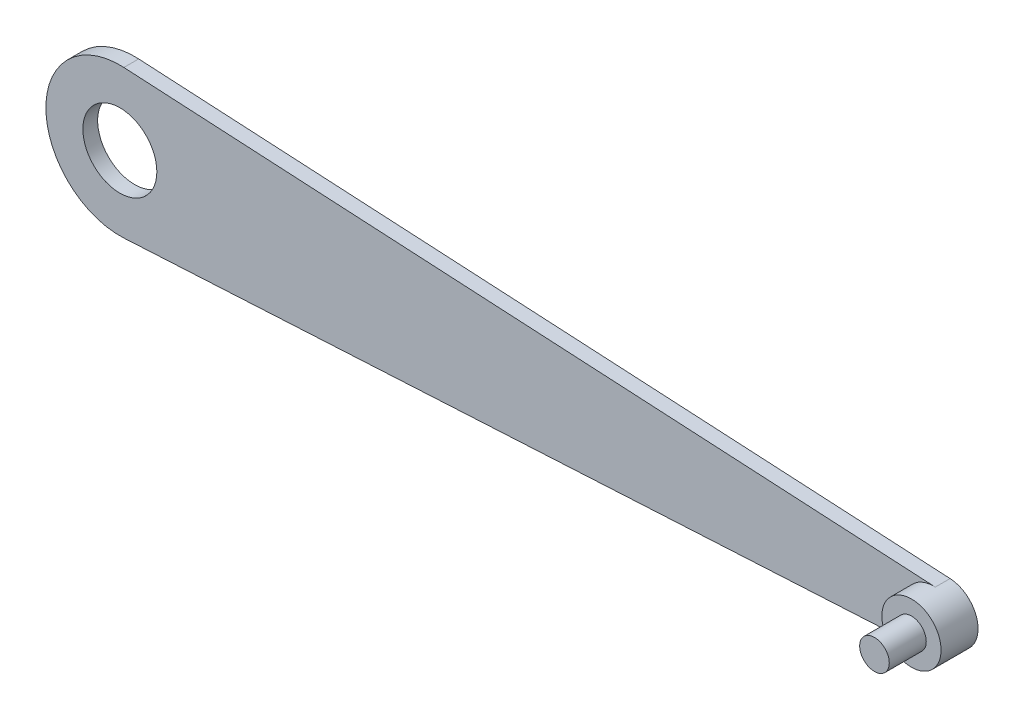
ISO-10303-21;
HEADER;
FILE_DESCRIPTION(('STEP AP214'),'2;1');
FILE_NAME('part.step','',(''),(''),'','','');
FILE_SCHEMA(('AUTOMOTIVE_DESIGN { 1 0 10303 214 1 1 1 1 }'));
ENDSEC;
DATA;
#1=APPLICATION_CONTEXT('core data for automotive mechanical design processes');
#2=APPLICATION_PROTOCOL_DEFINITION('international standard','automotive_design',2000,#1);
#3=PRODUCT_CONTEXT('',#1,'mechanical');
#4=PRODUCT('Part','Part','',(#3));
#5=PRODUCT_RELATED_PRODUCT_CATEGORY('part','',(#4));
#6=PRODUCT_DEFINITION_FORMATION('','',#4);
#7=PRODUCT_DEFINITION_CONTEXT('part definition',#1,'design');
#8=PRODUCT_DEFINITION('design','',#6,#7);
#9=PRODUCT_DEFINITION_SHAPE('','',#8);
#10=(LENGTH_UNIT() NAMED_UNIT(*) SI_UNIT(.MILLI.,.METRE.));
#11=(NAMED_UNIT(*) PLANE_ANGLE_UNIT() SI_UNIT($,.RADIAN.));
#12=(NAMED_UNIT(*) SI_UNIT($,.STERADIAN.) SOLID_ANGLE_UNIT());
#13=UNCERTAINTY_MEASURE_WITH_UNIT(LENGTH_MEASURE(1.E-05),#10,'distance_accuracy_value','');
#14=(GEOMETRIC_REPRESENTATION_CONTEXT(3) GLOBAL_UNCERTAINTY_ASSIGNED_CONTEXT((#13)) GLOBAL_UNIT_ASSIGNED_CONTEXT((#10,
#11,#12)) REPRESENTATION_CONTEXT('',''));
#15=CARTESIAN_POINT('',(0.,0.,0.));
#16=DIRECTION('',(0.,0.,1.));
#17=DIRECTION('',(1.,0.,0.));
#18=AXIS2_PLACEMENT_3D('',#15,#16,#17);
#19=CARTESIAN_POINT('',(0.,0.,1.));
#20=DIRECTION('',(0.,0.,-1.));
#21=DIRECTION('',(-1.,0.,0.));
#22=AXIS2_PLACEMENT_3D('',#19,#20,#21);
#23=CYLINDRICAL_SURFACE('',#22,5.);
#24=DIRECTION('',(0.,0.,-1.));
#25=VECTOR('',#24,1.);
#26=CARTESIAN_POINT('',(0.272727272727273,-4.99255644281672,1.));
#27=LINE('',#26,#25);
#28=CARTESIAN_POINT('',(0.272727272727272,-4.99255644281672,1.));
#29=VERTEX_POINT('',#28);
#30=CARTESIAN_POINT('',(0.272727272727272,-4.99255644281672,0.));
#31=VERTEX_POINT('',#30);
#32=EDGE_CURVE('E49',#29,#31,#27,.T.);
#33=ORIENTED_EDGE('',*,*,#32,.F.);
#34=CARTESIAN_POINT('',(0.,0.,1.));
#35=DIRECTION('',(0.,0.,1.));
#36=DIRECTION('',(1.,0.,0.));
#37=AXIS2_PLACEMENT_3D('',#34,#35,#36);
#38=CIRCLE('',#37,5.);
#39=CARTESIAN_POINT('',(0.272727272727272,4.99255644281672,1.));
#40=VERTEX_POINT('',#39);
#41=EDGE_CURVE('E11',#40,#29,#38,.T.);
#42=ORIENTED_EDGE('',*,*,#41,.F.);
#43=DIRECTION('',(0.,0.,-1.));
#44=VECTOR('',#43,1.);
#45=CARTESIAN_POINT('',(0.272727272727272,4.99255644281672,1.));
#46=LINE('',#45,#44);
#47=CARTESIAN_POINT('',(0.272727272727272,4.99255644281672,0.));
#48=VERTEX_POINT('',#47);
#49=EDGE_CURVE('E103',#40,#48,#46,.T.);
#50=ORIENTED_EDGE('',*,*,#49,.T.);
#51=CARTESIAN_POINT('',(0.,0.,0.));
#52=DIRECTION('',(0.,0.,1.));
#53=DIRECTION('',(1.,0.,0.));
#54=AXIS2_PLACEMENT_3D('',#51,#52,#53);
#55=CIRCLE('',#54,5.);
#56=EDGE_CURVE('E38',#48,#31,#55,.T.);
#57=ORIENTED_EDGE('',*,*,#56,.T.);
#58=EDGE_LOOP('',(#33,#42,#50,#57));
#59=FACE_BOUND('',#58,.T.);
#60=ADVANCED_FACE('F31',(#59),#23,.T.);
#61=CARTESIAN_POINT('',(0.,0.,1.));
#62=DIRECTION('',(0.,0.,1.));
#63=DIRECTION('',(1.,0.,0.));
#64=AXIS2_PLACEMENT_3D('',#61,#62,#63);
#65=PLANE('',#64);
#66=ORIENTED_EDGE('',*,*,#41,.T.);
#67=DIRECTION('',(0.998511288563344,0.0545454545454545,0.));
#68=VECTOR('',#67,1.);
#69=CARTESIAN_POINT('',(0.272727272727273,-4.99255644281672,1.));
#70=LINE('',#69,#68);
#71=CARTESIAN_POINT('',(55.1090909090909,-1.99702257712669,1.));
#72=VERTEX_POINT('',#71);
#73=EDGE_CURVE('E93',#29,#72,#70,.T.);
#74=ORIENTED_EDGE('',*,*,#73,.T.);
#75=CARTESIAN_POINT('',(55.,0.,1.));
#76=DIRECTION('',(0.,0.,-1.));
#77=DIRECTION('',(1.,0.,0.));
#78=AXIS2_PLACEMENT_3D('',#75,#76,#77);
#79=CIRCLE('',#78,2.);
#80=CARTESIAN_POINT('',(55.1090909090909,1.99702257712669,1.));
#81=VERTEX_POINT('',#80);
#82=EDGE_CURVE('E74',#72,#81,#79,.T.);
#83=ORIENTED_EDGE('',*,*,#82,.T.);
#84=DIRECTION('',(-0.998511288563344,0.0545454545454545,0.));
#85=VECTOR('',#84,1.);
#86=CARTESIAN_POINT('',(0.272727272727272,4.99255644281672,1.));
#87=LINE('',#86,#85);
#88=EDGE_CURVE('E100',#81,#40,#87,.T.);
#89=ORIENTED_EDGE('',*,*,#88,.T.);
#90=EDGE_LOOP('',(#66,#74,#83,#89));
#91=FACE_BOUND('',#90,.T.);
#92=CARTESIAN_POINT('',(0.,0.,1.));
#93=DIRECTION('',(0.,0.,1.));
#94=DIRECTION('',(1.,0.,0.));
#95=AXIS2_PLACEMENT_3D('',#92,#93,#94);
#96=CIRCLE('',#95,2.5);
#97=CARTESIAN_POINT('',(2.5,0.,1.));
#98=VERTEX_POINT('',#97);
#99=EDGE_CURVE('E110',#98,#98,#96,.T.);
#100=ORIENTED_EDGE('',*,*,#99,.F.);
#101=EDGE_LOOP('',(#100));
#102=FACE_BOUND('',#101,.T.);
#103=ADVANCED_FACE('F117',(#91,#102),#65,.T.);
#104=CARTESIAN_POINT('',(0.,0.,0.));
#105=DIRECTION('',(0.,0.,1.));
#106=DIRECTION('',(1.,0.,0.));
#107=AXIS2_PLACEMENT_3D('',#104,#105,#106);
#108=PLANE('',#107);
#109=ORIENTED_EDGE('',*,*,#56,.F.);
#110=DIRECTION('',(-0.998511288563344,0.0545454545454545,0.));
#111=VECTOR('',#110,1.);
#112=CARTESIAN_POINT('',(0.272727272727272,4.99255644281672,0.));
#113=LINE('',#112,#111);
#114=CARTESIAN_POINT('',(55.1090909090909,1.99702257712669,0.));
#115=VERTEX_POINT('',#114);
#116=EDGE_CURVE('E87',#115,#48,#113,.T.);
#117=ORIENTED_EDGE('',*,*,#116,.F.);
#118=CARTESIAN_POINT('',(55.,0.,0.));
#119=DIRECTION('',(0.,0.,1.));
#120=DIRECTION('',(1.,0.,0.));
#121=AXIS2_PLACEMENT_3D('',#118,#119,#120);
#122=CIRCLE('',#121,2.);
#123=CARTESIAN_POINT('',(55.1090909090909,-1.99702257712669,0.));
#124=VERTEX_POINT('',#123);
#125=EDGE_CURVE('E71',#124,#115,#122,.T.);
#126=ORIENTED_EDGE('',*,*,#125,.F.);
#127=DIRECTION('',(0.998511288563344,0.0545454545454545,0.));
#128=VECTOR('',#127,1.);
#129=CARTESIAN_POINT('',(0.272727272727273,-4.99255644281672,0.));
#130=LINE('',#129,#128);
#131=EDGE_CURVE('E85',#31,#124,#130,.T.);
#132=ORIENTED_EDGE('',*,*,#131,.F.);
#133=EDGE_LOOP('',(#109,#117,#126,#132));
#134=FACE_BOUND('',#133,.T.);
#135=CARTESIAN_POINT('',(0.,0.,0.));
#136=DIRECTION('',(0.,0.,1.));
#137=DIRECTION('',(1.,0.,0.));
#138=AXIS2_PLACEMENT_3D('',#135,#136,#137);
#139=CIRCLE('',#138,2.5);
#140=CARTESIAN_POINT('',(2.5,0.,0.));
#141=VERTEX_POINT('',#140);
#142=EDGE_CURVE('E107',#141,#141,#139,.T.);
#143=ORIENTED_EDGE('',*,*,#142,.T.);
#144=EDGE_LOOP('',(#143));
#145=FACE_BOUND('',#144,.T.);
#146=ADVANCED_FACE('F83',(#134,#145),#108,.F.);
#147=CARTESIAN_POINT('',(0.,0.,1.));
#148=DIRECTION('',(0.,0.,-1.));
#149=DIRECTION('',(-1.,0.,0.));
#150=AXIS2_PLACEMENT_3D('',#147,#148,#149);
#151=CYLINDRICAL_SURFACE('',#150,2.5);
#152=ORIENTED_EDGE('',*,*,#99,.T.);
#153=EDGE_LOOP('',(#152));
#154=FACE_BOUND('',#153,.T.);
#155=ORIENTED_EDGE('',*,*,#142,.F.);
#156=EDGE_LOOP('',(#155));
#157=FACE_BOUND('',#156,.T.);
#158=ADVANCED_FACE('F114',(#154,#157),#151,.F.);
#159=CARTESIAN_POINT('',(0.272727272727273,-4.99255644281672,1.));
#160=DIRECTION('',(-0.0545454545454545,0.998511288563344,0.));
#161=DIRECTION('',(-0.998511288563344,-0.0545454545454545,0.));
#162=AXIS2_PLACEMENT_3D('',#159,#160,#161);
#163=PLANE('',#162);
#164=ORIENTED_EDGE('',*,*,#131,.T.);
#165=DIRECTION('',(0.,0.,-1.));
#166=VECTOR('',#165,1.);
#167=CARTESIAN_POINT('',(55.1090909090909,-1.99702257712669,1.));
#168=LINE('',#167,#166);
#169=EDGE_CURVE('E67',#72,#124,#168,.T.);
#170=ORIENTED_EDGE('',*,*,#169,.F.);
#171=ORIENTED_EDGE('',*,*,#73,.F.);
#172=ORIENTED_EDGE('',*,*,#32,.T.);
#173=EDGE_LOOP('',(#164,#170,#171,#172));
#174=FACE_BOUND('',#173,.T.);
#175=ADVANCED_FACE('F91',(#174),#163,.F.);
#176=CARTESIAN_POINT('',(0.272727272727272,4.99255644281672,1.));
#177=DIRECTION('',(-0.0545454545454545,-0.998511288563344,0.));
#178=DIRECTION('',(0.998511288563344,-0.0545454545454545,0.));
#179=AXIS2_PLACEMENT_3D('',#176,#177,#178);
#180=PLANE('',#179);
#181=ORIENTED_EDGE('',*,*,#116,.T.);
#182=ORIENTED_EDGE('',*,*,#49,.F.);
#183=ORIENTED_EDGE('',*,*,#88,.F.);
#184=DIRECTION('',(0.,0.,-1.));
#185=VECTOR('',#184,1.);
#186=CARTESIAN_POINT('',(55.1090909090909,1.99702257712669,1.));
#187=LINE('',#186,#185);
#188=EDGE_CURVE('E79',#81,#115,#187,.T.);
#189=ORIENTED_EDGE('',*,*,#188,.T.);
#190=EDGE_LOOP('',(#181,#182,#183,#189));
#191=FACE_BOUND('',#190,.T.);
#192=ADVANCED_FACE('F130',(#191),#180,.F.);
#193=CARTESIAN_POINT('',(55.,0.,2.5));
#194=DIRECTION('',(0.,0.,1.));
#195=DIRECTION('',(1.,0.,0.));
#196=AXIS2_PLACEMENT_3D('',#193,#194,#195);
#197=PLANE('',#196);
#198=CARTESIAN_POINT('',(55.,0.,2.5));
#199=DIRECTION('',(0.,0.,1.));
#200=DIRECTION('',(1.,0.,0.));
#201=AXIS2_PLACEMENT_3D('',#198,#199,#200);
#202=CIRCLE('',#201,2.);
#203=CARTESIAN_POINT('',(57.,0.,2.5));
#204=VERTEX_POINT('',#203);
#205=EDGE_CURVE('E88',#204,#204,#202,.T.);
#206=ORIENTED_EDGE('',*,*,#205,.T.);
#207=EDGE_LOOP('',(#206));
#208=FACE_BOUND('',#207,.T.);
#209=CARTESIAN_POINT('',(55.,0.,2.5));
#210=DIRECTION('',(0.,0.,1.));
#211=DIRECTION('',(1.,0.,0.));
#212=AXIS2_PLACEMENT_3D('',#209,#210,#211);
#213=CIRCLE('',#212,0.999999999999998);
#214=CARTESIAN_POINT('',(56.,0.,2.5));
#215=VERTEX_POINT('',#214);
#216=EDGE_CURVE('E151',#215,#215,#213,.T.);
#217=ORIENTED_EDGE('',*,*,#216,.F.);
#218=EDGE_LOOP('',(#217));
#219=FACE_BOUND('',#218,.T.);
#220=ADVANCED_FACE('F133',(#208,#219),#197,.T.);
#221=CARTESIAN_POINT('',(55.,0.,2.5));
#222=DIRECTION('',(0.,0.,-1.));
#223=DIRECTION('',(-1.,0.,0.));
#224=AXIS2_PLACEMENT_3D('',#221,#222,#223);
#225=CYLINDRICAL_SURFACE('',#224,2.);
#226=ORIENTED_EDGE('',*,*,#169,.T.);
#227=ORIENTED_EDGE('',*,*,#125,.T.);
#228=ORIENTED_EDGE('',*,*,#188,.F.);
#229=ORIENTED_EDGE('',*,*,#82,.F.);
#230=EDGE_LOOP('',(#226,#227,#228,#229));
#231=FACE_BOUND('',#230,.T.);
#232=ORIENTED_EDGE('',*,*,#205,.F.);
#233=EDGE_LOOP('',(#232));
#234=FACE_BOUND('',#233,.T.);
#235=ADVANCED_FACE('F69',(#231,#234),#225,.T.);
#236=CARTESIAN_POINT('',(55.,0.,5.));
#237=DIRECTION('',(0.,0.,-1.));
#238=DIRECTION('',(-1.,0.,0.));
#239=AXIS2_PLACEMENT_3D('',#236,#237,#238);
#240=CYLINDRICAL_SURFACE('',#239,0.999999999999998);
#241=CARTESIAN_POINT('',(55.,0.,5.));
#242=DIRECTION('',(0.,0.,1.));
#243=DIRECTION('',(1.,0.,0.));
#244=AXIS2_PLACEMENT_3D('',#241,#242,#243);
#245=CIRCLE('',#244,0.999999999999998);
#246=CARTESIAN_POINT('',(56.,0.,5.));
#247=VERTEX_POINT('',#246);
#248=EDGE_CURVE('E89',#247,#247,#245,.T.);
#249=ORIENTED_EDGE('',*,*,#248,.F.);
#250=EDGE_LOOP('',(#249));
#251=FACE_BOUND('',#250,.T.);
#252=ORIENTED_EDGE('',*,*,#216,.T.);
#253=EDGE_LOOP('',(#252));
#254=FACE_BOUND('',#253,.T.);
#255=ADVANCED_FACE('F137',(#251,#254),#240,.T.);
#256=CARTESIAN_POINT('',(55.,0.,5.));
#257=DIRECTION('',(0.,0.,1.));
#258=DIRECTION('',(1.,0.,0.));
#259=AXIS2_PLACEMENT_3D('',#256,#257,#258);
#260=PLANE('',#259);
#261=ORIENTED_EDGE('',*,*,#248,.T.);
#262=EDGE_LOOP('',(#261));
#263=FACE_BOUND('',#262,.T.);
#264=ADVANCED_FACE('F143',(#263),#260,.T.);
#265=CLOSED_SHELL('',(#60,#103,#146,#158,#175,#192,#220,#235,#255,#264));
#266=MANIFOLD_SOLID_BREP('B2',#265);
#267=ADVANCED_BREP_SHAPE_REPRESENTATION('',(#18,#266),#14);
#268=SHAPE_DEFINITION_REPRESENTATION(#9,#267);
ENDSEC;
END-ISO-10303-21;
